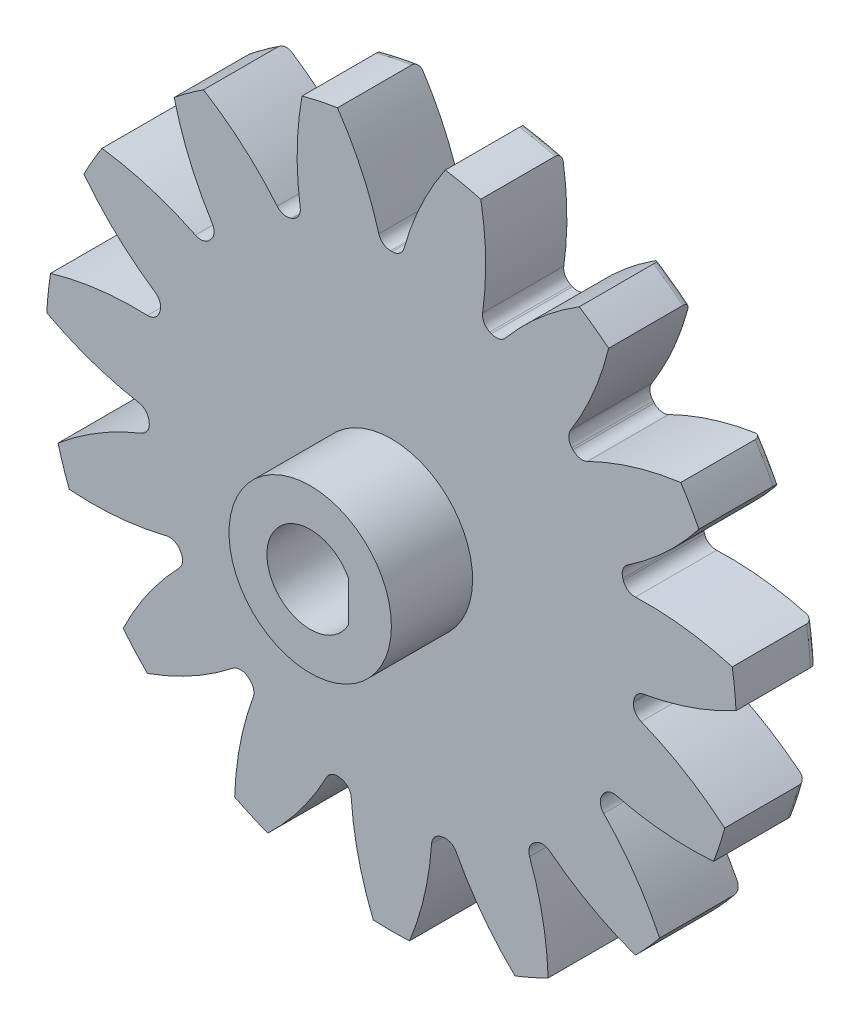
from build123d import *

# Parameters (mm, degrees)
FILLET2_R           = 0.255
CUT_EXTRUDE2_DEPTH  = 24.454743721
CIRPATTERN1_COUNT   = 15
CUT_EXTRUDE3_START  = -3
SKETCH8_R           = 15.504629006
CUT_EXTRUDE3_DEPTH  = 28.816934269
SKETCH9_R           = 4.496891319
BOSS_EXTRUDE1_DEPTH = 3
SKETCH10_R          = 3
BOSS_EXTRUDE2_DEPTH = 3
CUT_EXTRUDE4_DEPTH  = 19.991667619


with BuildPart() as part:
    # Sketch4 → Revolve1 (revolve)
    with BuildSketch(Plane(origin=(0, 0, 0), x_dir=(0, 0, -1), z_dir=(1, 0, 0))):
        Polygon((-25, 4), (-25, 9), (-15, 9), (-15, 12.75), (0, 12.75), (0, 4), align=None)
    revolve(axis=Axis((0, 0, 15), (0, 0, 1)))

    # Fillet2
    fillet2_edges = [part.edges().sort_by_distance(p)[0] for p in [
        (0, -12.75, 0),
        (0, -12.75, 15),
        (0, -9, 15),
        (0, -9, 25),
    ]]
    fillet(fillet2_edges, radius=FILLET2_R)

    # Sketch7 → Cut-Extrude2 (cut, through all)
    with BuildSketch(Plane.XY.offset(15)):
        with BuildLine():
            ThreePointArc((-0.030045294, 8.999949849), (0, 9), (0.030045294, 8.999949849))
            ThreePointArc((0.030045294, 8.999949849), (0.302290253, 9.090497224), (0.464494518, 9.327152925))
            ThreePointArc((0.464494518, 9.327152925), (1.096431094, 11.021894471), (1.991791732, 12.593461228))
            ThreePointArc((1.991791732, 12.593461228), (0, 12.75), (-1.991791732, 12.593461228))
            ThreePointArc((-1.991791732, 12.593461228), (-1.096431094, 11.021894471), (-0.464494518, 9.327152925))
            ThreePointArc((-0.464494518, 9.327152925), (-0.302290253, 9.090497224), (-0.030045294, 8.999949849))
        make_face()
    cut_extrude2 = extrude(amount=-CUT_EXTRUDE2_DEPTH, mode=Mode.SUBTRACT)

    # CirPattern1: Cut-Extrude2 ×15 about axis
    cirpattern1_axis = Axis((0, 0, 0), (0, 0, 1))
    for i in range(1, CIRPATTERN1_COUNT):
        add(cut_extrude2.rotate(cirpattern1_axis, i * 360 / CIRPATTERN1_COUNT), mode=Mode.SUBTRACT)

    # Sketch8 → Cut-Extrude3 (cut, through all)
    with BuildSketch(Plane(origin=(0, 0, 0), x_dir=(-1, 0, 0), z_dir=(0, 0, -1)).offset(CUT_EXTRUDE3_START)):
        Circle(SKETCH8_R)
    extrude(amount=-CUT_EXTRUDE3_DEPTH, mode=Mode.SUBTRACT)

    # Sketch9 → Boss-Extrude1 (add)
    with BuildSketch(Plane.XY.offset(3)):
        Circle(SKETCH9_R)
    extrude(amount=-BOSS_EXTRUDE1_DEPTH)

    # Sketch10 → Boss-Extrude2 (add)
    with BuildSketch(Plane.XY.offset(3)):
        with Locations(Location((0, 0, 0), (0, 0, 90))):
            Circle(SKETCH10_R)
    extrude(amount=BOSS_EXTRUDE2_DEPTH)

    # Sketch11 → Cut-Extrude4 (cut, through all)
    with BuildSketch(Plane.XY.offset(6)):
        with BuildLine():
            Line((1.413329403, -0.75), (1.413329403, 0.75))
            ThreePointArc((1.413329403, 0.75), (-1.6, 0), (1.413329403, -0.75))
        make_face()
    extrude(amount=-CUT_EXTRUDE4_DEPTH, mode=Mode.SUBTRACT)


solid = part.part
